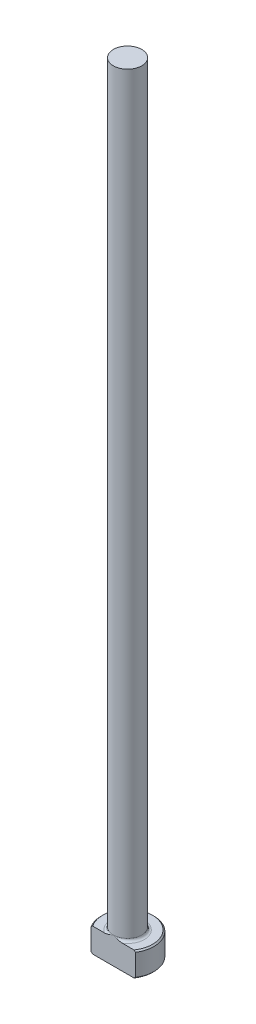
ISO-10303-21;
HEADER;
FILE_DESCRIPTION(('STEP AP214'),'2;1');
FILE_NAME('part.step','',(''),(''),'','','');
FILE_SCHEMA(('AUTOMOTIVE_DESIGN { 1 0 10303 214 1 1 1 1 }'));
ENDSEC;
DATA;
#1=APPLICATION_CONTEXT('core data for automotive mechanical design processes');
#2=APPLICATION_PROTOCOL_DEFINITION('international standard','automotive_design',2000,#1);
#3=PRODUCT_CONTEXT('',#1,'mechanical');
#4=PRODUCT('Part','Part','',(#3));
#5=PRODUCT_RELATED_PRODUCT_CATEGORY('part','',(#4));
#6=PRODUCT_DEFINITION_FORMATION('','',#4);
#7=PRODUCT_DEFINITION_CONTEXT('part definition',#1,'design');
#8=PRODUCT_DEFINITION('design','',#6,#7);
#9=PRODUCT_DEFINITION_SHAPE('','',#8);
#10=(LENGTH_UNIT() NAMED_UNIT(*) SI_UNIT(.MILLI.,.METRE.));
#11=(NAMED_UNIT(*) PLANE_ANGLE_UNIT() SI_UNIT($,.RADIAN.));
#12=(NAMED_UNIT(*) SI_UNIT($,.STERADIAN.) SOLID_ANGLE_UNIT());
#13=UNCERTAINTY_MEASURE_WITH_UNIT(LENGTH_MEASURE(1.E-05),#10,'distance_accuracy_value','');
#14=(GEOMETRIC_REPRESENTATION_CONTEXT(3) GLOBAL_UNCERTAINTY_ASSIGNED_CONTEXT((#13)) GLOBAL_UNIT_ASSIGNED_CONTEXT((#10,
#11,#12)) REPRESENTATION_CONTEXT('',''));
#15=CARTESIAN_POINT('',(0.,0.,0.));
#16=DIRECTION('',(0.,0.,1.));
#17=DIRECTION('',(1.,0.,0.));
#18=AXIS2_PLACEMENT_3D('',#15,#16,#17);
#19=CARTESIAN_POINT('',(0.,0.,0.));
#20=DIRECTION('',(0.,-1.,0.));
#21=DIRECTION('',(0.,0.,-1.));
#22=AXIS2_PLACEMENT_3D('',#19,#20,#21);
#23=PLANE('',#22);
#24=DIRECTION('',(1.,0.,0.));
#25=VECTOR('',#24,1.);
#26=CARTESIAN_POINT('',(-4.34418550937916,0.,2.77748999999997));
#27=LINE('',#26,#25);
#28=CARTESIAN_POINT('',(-4.03944478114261,0.,2.77748999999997));
#29=VERTEX_POINT('',#28);
#30=CARTESIAN_POINT('',(4.03944478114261,0.,2.77748999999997));
#31=VERTEX_POINT('',#30);
#32=EDGE_CURVE('E92',#29,#31,#27,.T.);
#33=ORIENTED_EDGE('',*,*,#32,.F.);
#34=CARTESIAN_POINT('',(0.,0.,0.));
#35=DIRECTION('',(0.,-1.,0.));
#36=DIRECTION('',(0.,0.,-1.));
#37=AXIS2_PLACEMENT_3D('',#34,#35,#36);
#38=CIRCLE('',#37,4.90220000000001);
#39=EDGE_CURVE('E105',#29,#31,#38,.T.);
#40=ORIENTED_EDGE('',*,*,#39,.T.);
#41=EDGE_LOOP('',(#33,#40));
#42=FACE_BOUND('',#41,.T.);
#43=ADVANCED_FACE('F37',(#42),#23,.T.);
#44=CARTESIAN_POINT('',(0.,259.958771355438,0.));
#45=DIRECTION('',(0.,1.,0.));
#46=DIRECTION('',(0.,0.,1.));
#47=AXIS2_PLACEMENT_3D('',#44,#45,#46);
#48=CYLINDRICAL_SURFACE('',#47,5.15619999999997);
#49=DIRECTION('',(0.,-1.,0.));
#50=VECTOR('',#49,1.);
#51=CARTESIAN_POINT('',(-4.34418550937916,152.4,2.77748999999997));
#52=LINE('',#51,#50);
#53=CARTESIAN_POINT('',(-4.34418550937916,4.49580000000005,2.77748999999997));
#54=VERTEX_POINT('',#53);
#55=CARTESIAN_POINT('',(-4.34418550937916,0.253999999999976,2.77748999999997));
#56=VERTEX_POINT('',#55);
#57=EDGE_CURVE('E95',#54,#56,#52,.T.);
#58=ORIENTED_EDGE('',*,*,#57,.F.);
#59=CARTESIAN_POINT('',(0.,4.49580000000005,0.));
#60=DIRECTION('',(0.,1.,0.));
#61=DIRECTION('',(0.,0.,1.));
#62=AXIS2_PLACEMENT_3D('',#59,#60,#61);
#63=CIRCLE('',#62,5.15619999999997);
#64=CARTESIAN_POINT('',(4.34418550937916,4.49580000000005,2.77748999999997));
#65=VERTEX_POINT('',#64);
#66=EDGE_CURVE('E109',#54,#65,#63,.F.);
#67=ORIENTED_EDGE('',*,*,#66,.T.);
#68=DIRECTION('',(0.,-1.,0.));
#69=VECTOR('',#68,1.);
#70=CARTESIAN_POINT('',(4.34418550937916,152.4,2.77748999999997));
#71=LINE('',#70,#69);
#72=CARTESIAN_POINT('',(4.34418550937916,0.253999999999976,2.77748999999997));
#73=VERTEX_POINT('',#72);
#74=EDGE_CURVE('E187',#65,#73,#71,.T.);
#75=ORIENTED_EDGE('',*,*,#74,.T.);
#76=CARTESIAN_POINT('',(0.,0.253999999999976,0.));
#77=DIRECTION('',(0.,-1.,0.));
#78=DIRECTION('',(0.,0.,-1.));
#79=AXIS2_PLACEMENT_3D('',#76,#77,#78);
#80=CIRCLE('',#79,5.15619999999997);
#81=EDGE_CURVE('E115',#73,#56,#80,.F.);
#82=ORIENTED_EDGE('',*,*,#81,.T.);
#83=EDGE_LOOP('',(#58,#67,#75,#82));
#84=FACE_BOUND('',#83,.T.);
#85=ADVANCED_FACE('F160',(#84),#48,.T.);
#86=CARTESIAN_POINT('',(-5.15619999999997,4.7498,0.));
#87=DIRECTION('',(0.,1.,0.));
#88=DIRECTION('',(0.,0.,1.));
#89=AXIS2_PLACEMENT_3D('',#86,#87,#88);
#90=PLANE('',#89);
#91=DIRECTION('',(-1.,0.,0.));
#92=VECTOR('',#91,1.);
#93=CARTESIAN_POINT('',(-5.15619999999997,4.7498,2.77748999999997));
#94=LINE('',#93,#92);
#95=CARTESIAN_POINT('',(4.03944478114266,4.7498,2.77748999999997));
#96=VERTEX_POINT('',#95);
#97=CARTESIAN_POINT('',(1.75499112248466,4.7498,2.77748999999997));
#98=VERTEX_POINT('',#97);
#99=EDGE_CURVE('E58',#96,#98,#94,.T.);
#100=ORIENTED_EDGE('',*,*,#99,.F.);
#101=CARTESIAN_POINT('',(0.,4.7498,0.));
#102=DIRECTION('',(0.,1.,0.));
#103=DIRECTION('',(0.,0.,1.));
#104=AXIS2_PLACEMENT_3D('',#101,#102,#103);
#105=CIRCLE('',#104,4.90220000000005);
#106=CARTESIAN_POINT('',(-4.03944478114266,4.7498,2.77748999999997));
#107=VERTEX_POINT('',#106);
#108=EDGE_CURVE('E182',#96,#107,#105,.T.);
#109=ORIENTED_EDGE('',*,*,#108,.T.);
#110=CARTESIAN_POINT('',(-1.75499112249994,4.74979999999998,2.77748999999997));
#111=VERTEX_POINT('',#110);
#112=EDGE_CURVE('E140',#111,#107,#94,.T.);
#113=ORIENTED_EDGE('',*,*,#112,.F.);
#114=CARTESIAN_POINT('',(0.,4.7498,0.));
#115=DIRECTION('',(0.,1.,0.));
#116=DIRECTION('',(0.,0.,1.));
#117=AXIS2_PLACEMENT_3D('',#114,#115,#116);
#118=CIRCLE('',#117,3.28548999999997);
#119=EDGE_CURVE('E112',#111,#98,#118,.F.);
#120=ORIENTED_EDGE('',*,*,#119,.T.);
#121=EDGE_LOOP('',(#100,#109,#113,#120));
#122=FACE_BOUND('',#121,.T.);
#123=ADVANCED_FACE('F164',(#122),#90,.T.);
#124=CARTESIAN_POINT('',(0.,259.958771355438,0.));
#125=DIRECTION('',(0.,1.,0.));
#126=DIRECTION('',(0.,0.,1.));
#127=AXIS2_PLACEMENT_3D('',#124,#125,#126);
#128=CYLINDRICAL_SURFACE('',#127,2.77748999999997);
#129=CARTESIAN_POINT('',(0.,5.25779999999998,0.));
#130=DIRECTION('',(0.,1.,0.));
#131=DIRECTION('',(0.,0.,1.));
#132=AXIS2_PLACEMENT_3D('',#129,#130,#131);
#133=CIRCLE('',#132,2.77748999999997);
#134=CARTESIAN_POINT('',(0.,5.25779999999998,2.77748999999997));
#135=VERTEX_POINT('',#134);
#136=EDGE_CURVE('E108',#135,#135,#133,.T.);
#137=ORIENTED_EDGE('',*,*,#136,.T.);
#138=EDGE_LOOP('',(#137));
#139=FACE_BOUND('',#138,.T.);
#140=CARTESIAN_POINT('',(0.,152.4,0.));
#141=DIRECTION('',(0.,1.,0.));
#142=DIRECTION('',(0.,0.,1.));
#143=AXIS2_PLACEMENT_3D('',#140,#141,#142);
#144=CIRCLE('',#143,2.77748999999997);
#145=CARTESIAN_POINT('',(0.,152.4,2.77748999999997));
#146=VERTEX_POINT('',#145);
#147=EDGE_CURVE('E100',#146,#146,#144,.T.);
#148=ORIENTED_EDGE('',*,*,#147,.F.);
#149=EDGE_LOOP('',(#148));
#150=FACE_BOUND('',#149,.T.);
#151=ADVANCED_FACE('F169',(#139,#150),#128,.T.);
#152=CARTESIAN_POINT('',(-2.77748999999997,152.4,0.));
#153=DIRECTION('',(0.,1.,0.));
#154=DIRECTION('',(0.,0.,1.));
#155=AXIS2_PLACEMENT_3D('',#152,#153,#154);
#156=PLANE('',#155);
#157=ORIENTED_EDGE('',*,*,#147,.T.);
#158=EDGE_LOOP('',(#157));
#159=FACE_BOUND('',#158,.T.);
#160=ADVANCED_FACE('F127',(#159),#156,.T.);
#161=CARTESIAN_POINT('',(0.,4.74980000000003,0.));
#162=DIRECTION('',(0.,-1.,0.));
#163=DIRECTION('',(0.,0.,-1.));
#164=AXIS2_PLACEMENT_3D('',#161,#162,#163);
#165=CONICAL_SURFACE('',#164,4.90220000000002,0.785398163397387);
#166=CARTESIAN_POINT('',(4.34488550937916,4.49521022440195,2.77748999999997));
#167=CARTESIAN_POINT('',(4.20993690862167,4.60885588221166,2.77748999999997));
#168=CARTESIAN_POINT('',(4.07427343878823,4.72167469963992,2.77748999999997));
#169=CARTESIAN_POINT('',(3.80095692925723,4.94505099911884,2.77748999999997));
#170=CARTESIAN_POINT('',(3.66330268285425,5.0556070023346,2.77748999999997));
#171=CARTESIAN_POINT('',(3.38009900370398,5.27803624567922,2.77748999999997));
#172=CARTESIAN_POINT('',(3.23445316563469,5.38978734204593,2.77748999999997));
#173=CARTESIAN_POINT('',(2.93986117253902,5.60879512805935,2.77748999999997));
#174=CARTESIAN_POINT('',(2.79091596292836,5.71605308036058,2.77748999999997));
#175=CARTESIAN_POINT('',(2.48820661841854,5.92459661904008,2.77748999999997));
#176=CARTESIAN_POINT('',(2.33442927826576,6.02586317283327,2.77748999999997));
#177=CARTESIAN_POINT('',(2.02092534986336,6.21931846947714,2.77748999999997));
#178=CARTESIAN_POINT('',(1.86119293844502,6.31149798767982,2.77748999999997));
#179=CARTESIAN_POINT('',(1.61743593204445,6.4386068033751,2.77748999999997));
#180=CARTESIAN_POINT('',(1.53618520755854,6.47882584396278,2.77748999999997));
#181=CARTESIAN_POINT('',(1.37175662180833,6.55509214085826,2.77748999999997));
#182=CARTESIAN_POINT('',(1.28857851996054,6.59113887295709,2.77748999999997));
#183=CARTESIAN_POINT('',(1.0362891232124,6.69148417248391,2.77748999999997));
#184=CARTESIAN_POINT('',(0.863938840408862,6.74825197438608,2.77748999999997));
#185=CARTESIAN_POINT('',(0.599330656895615,6.81189394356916,2.77748999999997));
#186=CARTESIAN_POINT('',(0.509632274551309,6.82955765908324,2.77748999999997));
#187=CARTESIAN_POINT('',(0.328961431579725,6.85652082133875,2.77748999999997));
#188=CARTESIAN_POINT('',(0.237989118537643,6.86582122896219,2.77748999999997));
#189=CARTESIAN_POINT('',(0.0557770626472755,6.87543652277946,2.77748999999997));
#190=CARTESIAN_POINT('',(-0.0354615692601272,6.87577221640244,2.77748999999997));
#191=CARTESIAN_POINT('',(-0.217532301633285,6.86748964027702,2.77748999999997));
#192=CARTESIAN_POINT('',(-0.30836436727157,6.85887061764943,2.77748999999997));
#193=CARTESIAN_POINT('',(-0.487727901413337,6.83339482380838,2.77748999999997));
#194=CARTESIAN_POINT('',(-0.576273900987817,6.81663841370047,2.77748999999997));
#195=CARTESIAN_POINT('',(-0.751660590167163,6.77586328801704,2.77748999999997));
#196=CARTESIAN_POINT('',(-0.838501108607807,6.75184384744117,2.77748999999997));
#197=CARTESIAN_POINT('',(-1.01126966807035,6.69729035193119,2.77748999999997));
#198=CARTESIAN_POINT('',(-1.09717311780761,6.66667935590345,2.77748999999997));
#199=CARTESIAN_POINT('',(-1.26688365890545,6.60022140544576,2.77748999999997));
#200=CARTESIAN_POINT('',(-1.35069119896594,6.56437558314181,2.77748999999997));
#201=CARTESIAN_POINT('',(-1.57329136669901,6.46229361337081,2.77748999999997));
#202=CARTESIAN_POINT('',(-1.71026804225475,6.3921087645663,2.77748999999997));
#203=CARTESIAN_POINT('',(-1.9795048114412,6.24314123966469,2.77748999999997));
#204=CARTESIAN_POINT('',(-2.11176089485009,6.16435147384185,2.77748999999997));
#205=CARTESIAN_POINT('',(-2.37294305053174,6.0002947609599,2.77748999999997));
#206=CARTESIAN_POINT('',(-2.50185266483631,5.91500181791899,2.77748999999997));
#207=CARTESIAN_POINT('',(-2.75650815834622,5.73993540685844,2.77748999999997));
#208=CARTESIAN_POINT('',(-2.88225502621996,5.65016336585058,2.77748999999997));
#209=CARTESIAN_POINT('',(-3.12213616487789,5.47395421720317,2.77748999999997));
#210=CARTESIAN_POINT('',(-3.23644602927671,5.38775497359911,2.77748999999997));
#211=CARTESIAN_POINT('',(-3.46333532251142,5.21309197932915,2.77748999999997));
#212=CARTESIAN_POINT('',(-3.57591458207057,5.12462800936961,2.77748999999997));
#213=CARTESIAN_POINT('',(-3.798558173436,4.94678562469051,2.77748999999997));
#214=CARTESIAN_POINT('',(-3.90863631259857,4.8574244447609,2.77748999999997));
#215=CARTESIAN_POINT('',(-4.12759528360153,4.67729610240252,2.77748999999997));
#216=CARTESIAN_POINT('',(-4.23647638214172,4.58652926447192,2.77748999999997));
#217=CARTESIAN_POINT('',(-4.34488550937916,4.49521022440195,2.77748999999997));
#218=B_SPLINE_CURVE_WITH_KNOTS('',3,(#166,#167,#168,#169,#170,#171,#172,#173,#174,#175,#176,
#177,#178,#179,#180,#181,#182,#183,#184,#185,#186,#187,#188,#189,#190,#191,#192,#193,#194,#195,
#196,#197,#198,#199,#200,#201,#202,#203,#204,#205,#206,#207,#208,#209,#210,#211,#212,#213,#214,
#215,#216,#217),.UNSPECIFIED.,.F.,.F.,(4,2,2,2,2,2,2,2,2,2,2,2,2,2,2,2,2,2,2,2,2,2,2,2,2,4),(0.,
0.52929870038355,1.05893293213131,1.6096072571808,2.1601257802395,2.71230834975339,
3.26504581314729,3.53691442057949,3.80881714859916,4.35097628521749,4.6249157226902,
4.89882368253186,5.17209583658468,5.44539096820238,5.71539791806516,5.98543182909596,
6.25880745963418,6.5321240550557,6.9933732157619,7.45500531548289,7.91859069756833,
8.38202931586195,8.81149885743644,9.24101014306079,9.66634846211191,10.0915900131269),.UNSPECIFIED.);
#219=EDGE_CURVE('E63',#65,#96,#218,.T.);
#220=ORIENTED_EDGE('',*,*,#219,.F.);
#221=ORIENTED_EDGE('',*,*,#66,.F.);
#222=EDGE_CURVE('E133',#107,#54,#218,.T.);
#223=ORIENTED_EDGE('',*,*,#222,.F.);
#224=ORIENTED_EDGE('',*,*,#108,.F.);
#225=EDGE_LOOP('',(#220,#221,#223,#224));
#226=FACE_BOUND('',#225,.T.);
#227=ADVANCED_FACE('F147',(#226),#165,.T.);
#228=CARTESIAN_POINT('',(0.,0.253999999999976,0.));
#229=DIRECTION('',(0.,1.,0.));
#230=DIRECTION('',(0.,0.,1.));
#231=AXIS2_PLACEMENT_3D('',#228,#229,#230);
#232=CONICAL_SURFACE('',#231,5.15619999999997,0.785398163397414);
#233=CARTESIAN_POINT('',(-4.34488550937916,0.254589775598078,2.77748999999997));
#234=CARTESIAN_POINT('',(-4.20993690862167,0.140944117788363,2.77748999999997));
#235=CARTESIAN_POINT('',(-4.07427343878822,0.0281253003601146,2.77748999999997));
#236=CARTESIAN_POINT('',(-3.8009569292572,-0.195250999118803,2.77748999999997));
#237=CARTESIAN_POINT('',(-3.66330268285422,-0.305807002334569,2.77748999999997));
#238=CARTESIAN_POINT('',(-3.38009900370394,-0.528236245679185,2.77748999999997));
#239=CARTESIAN_POINT('',(-3.23445316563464,-0.639987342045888,2.77748999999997));
#240=CARTESIAN_POINT('',(-2.93986117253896,-0.858995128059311,2.77748999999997));
#241=CARTESIAN_POINT('',(-2.79091596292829,-0.966253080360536,2.77748999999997));
#242=CARTESIAN_POINT('',(-2.48820661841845,-1.17479661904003,2.77748999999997));
#243=CARTESIAN_POINT('',(-2.33442927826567,-1.27606317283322,2.77748999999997));
#244=CARTESIAN_POINT('',(-2.02092534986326,-1.46951846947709,2.77748999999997));
#245=CARTESIAN_POINT('',(-1.8611929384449,-1.56169798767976,2.77748999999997));
#246=CARTESIAN_POINT('',(-1.61743593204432,-1.68880680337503,2.77748999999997));
#247=CARTESIAN_POINT('',(-1.5361852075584,-1.72902584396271,2.77748999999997));
#248=CARTESIAN_POINT('',(-1.37175662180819,-1.80529214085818,2.77748999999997));
#249=CARTESIAN_POINT('',(-1.2885785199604,-1.84133887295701,2.77748999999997));
#250=CARTESIAN_POINT('',(-1.03628912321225,-1.94168417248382,2.77748999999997));
#251=CARTESIAN_POINT('',(-0.8639388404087,-1.99845197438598,2.77748999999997));
#252=CARTESIAN_POINT('',(-0.59933065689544,-2.06209394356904,2.77748999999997));
#253=CARTESIAN_POINT('',(-0.509632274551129,-2.07975765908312,2.77748999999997));
#254=CARTESIAN_POINT('',(-0.328961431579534,-2.10672082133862,2.77748999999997));
#255=CARTESIAN_POINT('',(-0.237989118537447,-2.11602122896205,2.77748999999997));
#256=CARTESIAN_POINT('',(-0.0557770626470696,-2.12563652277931,2.77748999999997));
#257=CARTESIAN_POINT('',(0.0354615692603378,-2.12597221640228,2.77748999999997));
#258=CARTESIAN_POINT('',(0.217532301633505,-2.11768964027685,2.77748999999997));
#259=CARTESIAN_POINT('',(0.308364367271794,-2.10907061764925,2.77748999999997));
#260=CARTESIAN_POINT('',(0.487727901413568,-2.08359482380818,2.77748999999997));
#261=CARTESIAN_POINT('',(0.57627390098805,-2.06683841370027,2.77748999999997));
#262=CARTESIAN_POINT('',(0.751660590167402,-2.02606328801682,2.77748999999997));
#263=CARTESIAN_POINT('',(0.838501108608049,-2.00204384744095,2.77748999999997));
#264=CARTESIAN_POINT('',(1.0112696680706,-1.94749035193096,2.77748999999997));
#265=CARTESIAN_POINT('',(1.09717311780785,-1.91687935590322,2.77748999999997));
#266=CARTESIAN_POINT('',(1.2668836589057,-1.85042140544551,2.77748999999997));
#267=CARTESIAN_POINT('',(1.35069119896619,-1.81457558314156,2.77748999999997));
#268=CARTESIAN_POINT('',(1.57329136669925,-1.71249361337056,2.77748999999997));
#269=CARTESIAN_POINT('',(1.71026804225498,-1.64230876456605,2.77748999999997));
#270=CARTESIAN_POINT('',(1.97950481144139,-1.49334123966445,2.77748999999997));
#271=CARTESIAN_POINT('',(2.11176089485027,-1.41455147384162,2.77748999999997));
#272=CARTESIAN_POINT('',(2.37294305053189,-1.25049476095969,2.77748999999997));
#273=CARTESIAN_POINT('',(2.50185266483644,-1.1652018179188,2.77748999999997));
#274=CARTESIAN_POINT('',(2.75650815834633,-0.99013540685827,2.77748999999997));
#275=CARTESIAN_POINT('',(2.88225502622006,-0.900363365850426,2.77748999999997));
#276=CARTESIAN_POINT('',(3.12213616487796,-0.724154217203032,2.77748999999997));
#277=CARTESIAN_POINT('',(3.23644602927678,-0.637954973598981,2.77748999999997));
#278=CARTESIAN_POINT('',(3.46333532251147,-0.463291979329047,2.77748999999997));
#279=CARTESIAN_POINT('',(3.57591458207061,-0.374828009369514,2.77748999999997));
#280=CARTESIAN_POINT('',(3.79855817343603,-0.196985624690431,2.77748999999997));
#281=CARTESIAN_POINT('',(3.90863631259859,-0.107624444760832,2.77748999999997));
#282=CARTESIAN_POINT('',(4.12759528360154,0.0725038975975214,2.77748999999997));
#283=CARTESIAN_POINT('',(4.23647638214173,0.16327073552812,2.77748999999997));
#284=CARTESIAN_POINT('',(4.34488550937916,0.254589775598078,2.77748999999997));
#285=B_SPLINE_CURVE_WITH_KNOTS('',3,(#233,#234,#235,#236,#237,#238,#239,#240,#241,#242,#243,
#244,#245,#246,#247,#248,#249,#250,#251,#252,#253,#254,#255,#256,#257,#258,#259,#260,#261,#262,
#263,#264,#265,#266,#267,#268,#269,#270,#271,#272,#273,#274,#275,#276,#277,#278,#279,#280,#281,
#282,#283,#284),.UNSPECIFIED.,.F.,.F.,(4,2,2,2,2,2,2,2,2,2,2,2,2,2,2,2,2,2,2,2,2,2,2,2,2,4),(0.,
0.52929870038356,1.05893293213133,1.60960725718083,2.16012578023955,2.71230834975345,
3.26504581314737,3.53691442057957,3.80881714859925,4.3509762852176,4.62491572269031,
4.898823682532,5.17209583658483,5.44539096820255,5.71539791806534,5.98543182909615,
6.25880745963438,6.53212405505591,6.99337321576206,7.455005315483,7.91859069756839,
8.38202931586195,8.81149885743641,9.24101014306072,9.66634846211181,10.0915900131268),.UNSPECIFIED.);
#286=EDGE_CURVE('E89',#56,#29,#285,.T.);
#287=ORIENTED_EDGE('',*,*,#286,.F.);
#288=ORIENTED_EDGE('',*,*,#81,.F.);
#289=EDGE_CURVE('E101',#31,#73,#285,.T.);
#290=ORIENTED_EDGE('',*,*,#289,.F.);
#291=ORIENTED_EDGE('',*,*,#39,.F.);
#292=EDGE_LOOP('',(#287,#288,#290,#291));
#293=FACE_BOUND('',#292,.T.);
#294=ADVANCED_FACE('F107',(#293),#232,.T.);
#295=CARTESIAN_POINT('',(0.,5.25779999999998,0.));
#296=DIRECTION('',(0.,1.,0.));
#297=DIRECTION('',(0.,0.,1.));
#298=AXIS2_PLACEMENT_3D('',#295,#296,#297);
#299=TOROIDAL_SURFACE('',#298,3.28548999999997,0.508);
#300=ORIENTED_EDGE('',*,*,#119,.F.);
#301=CARTESIAN_POINT('',(0.,5.25779999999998,2.77748999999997));
#302=CARTESIAN_POINT('',(3.63480565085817E-11,5.25780081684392,2.77748999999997));
#303=CARTESIAN_POINT('',(-1.58527088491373E-07,5.25780163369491,2.77748999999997));
#304=CARTESIAN_POINT('',(-6.68759388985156E-07,5.25780321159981,2.77748999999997));
#305=CARTESIAN_POINT('',(-1.02470275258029E-06,5.25780397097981,2.77748999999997));
#306=CARTESIAN_POINT('',(-1.88230728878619E-06,5.25780548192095,2.77748999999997));
#307=CARTESIAN_POINT('',(-2.39329363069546E-06,5.25780622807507,2.77748999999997));
#308=CARTESIAN_POINT('',(-3.50054720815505E-06,5.25780764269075,2.77748999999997));
#309=CARTESIAN_POINT('',(-4.09620350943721E-06,5.25780831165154,2.77748999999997));
#310=CARTESIAN_POINT('',(-6.21505861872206E-06,5.25781052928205,2.77748999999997));
#311=CARTESIAN_POINT('',(-7.84997964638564E-06,5.25781197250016,2.77748999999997));
#312=CARTESIAN_POINT('',(-1.12461435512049E-05,5.25781456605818,2.77748999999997));
#313=CARTESIAN_POINT('',(-1.30017650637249E-05,5.25781572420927,2.77748999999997));
#314=CARTESIAN_POINT('',(-1.97830813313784E-05,5.25782001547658,2.77748999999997));
#315=CARTESIAN_POINT('',(-2.49606936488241E-05,5.25782291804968,2.77748999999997));
#316=CARTESIAN_POINT('',(-3.52264964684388E-05,5.25782772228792,2.77748999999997));
#317=CARTESIAN_POINT('',(-4.02861099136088E-05,5.25782968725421,2.77748999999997));
#318=CARTESIAN_POINT('',(-6.16428547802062E-05,5.2578379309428,2.77748999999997));
#319=CARTESIAN_POINT('',(-7.79686338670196E-05,5.25784410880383,2.77748999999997));
#320=CARTESIAN_POINT('',(-0.000108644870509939,5.25785412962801,2.77748999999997));
#321=CARTESIAN_POINT('',(-0.00012292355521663,5.2578581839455,2.77748999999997));
#322=CARTESIAN_POINT('',(-0.000225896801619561,5.25789001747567,2.77748999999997));
#323=CARTESIAN_POINT('',(-0.000310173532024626,5.25793021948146,2.77748999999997));
#324=CARTESIAN_POINT('',(-0.00063679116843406,5.25808026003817,2.77748999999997));
#325=CARTESIAN_POINT('',(-0.000882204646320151,5.25818086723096,2.77748999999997));
#326=CARTESIAN_POINT('',(-0.0018311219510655,5.25857573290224,2.77748999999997));
#327=CARTESIAN_POINT('',(-0.00253146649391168,5.25887966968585,2.77748999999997));
#328=CARTESIAN_POINT('',(-0.00538269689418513,5.26011107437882,2.77748999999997));
#329=CARTESIAN_POINT('',(-0.00753706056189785,5.26102768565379,2.77748999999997));
#330=CARTESIAN_POINT('',(-0.0523267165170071,5.28009176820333,2.77748999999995));
#331=CARTESIAN_POINT('',(-0.0949226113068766,5.29836433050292,2.77748999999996));
#332=CARTESIAN_POINT('',(-0.178660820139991,5.33400805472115,2.77748999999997));
#333=CARTESIAN_POINT('',(-0.219799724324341,5.35138784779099,2.77748999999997));
#334=CARTESIAN_POINT('',(-0.306925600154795,5.38783884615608,2.77748999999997));
#335=CARTESIAN_POINT('',(-0.352927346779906,5.40687537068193,2.77748999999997));
#336=CARTESIAN_POINT('',(-0.445632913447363,5.44454742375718,2.77748999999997));
#337=CARTESIAN_POINT('',(-0.492339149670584,5.46317702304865,2.77748999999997));
#338=CARTESIAN_POINT('',(-0.574123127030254,5.49497229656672,2.77748999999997));
#339=CARTESIAN_POINT('',(-0.60912979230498,5.50832012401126,2.77748999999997));
#340=CARTESIAN_POINT('',(-0.679265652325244,5.53442851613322,2.77748999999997));
#341=CARTESIAN_POINT('',(-0.714394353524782,5.54719040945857,2.77748999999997));
#342=CARTESIAN_POINT('',(-0.818611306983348,5.58395598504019,2.77748999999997));
#343=CARTESIAN_POINT('',(-0.888033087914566,5.60703279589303,2.77748999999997));
#344=CARTESIAN_POINT('',(-1.01885178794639,5.64701930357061,2.77748999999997));
#345=CARTESIAN_POINT('',(-1.0801217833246,5.66434067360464,2.77748999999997));
#346=CARTESIAN_POINT('',(-1.20389830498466,5.69582437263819,2.77748999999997));
#347=CARTESIAN_POINT('',(-1.26641022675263,5.70996583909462,2.77748999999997));
#348=CARTESIAN_POINT('',(-1.39563114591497,5.73475443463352,2.77748999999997));
#349=CARTESIAN_POINT('',(-1.46238514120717,5.74517289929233,2.77748999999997));
#350=CARTESIAN_POINT('',(-1.5964208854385,5.76016238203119,2.77748999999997));
#351=CARTESIAN_POINT('',(-1.6637008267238,5.76474842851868,2.77748999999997));
#352=CARTESIAN_POINT('',(-1.78334896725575,5.76633336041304,2.77748999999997));
#353=CARTESIAN_POINT('',(-1.83569286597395,5.76479753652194,2.77748999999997));
#354=CARTESIAN_POINT('',(-1.93953534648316,5.75634035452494,2.77748999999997));
#355=CARTESIAN_POINT('',(-1.99103732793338,5.74946529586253,2.77748999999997));
#356=CARTESIAN_POINT('',(-2.09352832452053,5.72907082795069,2.77748999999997));
#357=CARTESIAN_POINT('',(-2.14449935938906,5.71545744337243,2.77748999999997));
#358=CARTESIAN_POINT('',(-2.2436267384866,5.67996337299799,2.77748999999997));
#359=CARTESIAN_POINT('',(-2.29178599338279,5.65809141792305,2.77748999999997));
#360=CARTESIAN_POINT('',(-2.36178980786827,5.61652411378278,2.77748999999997));
#361=CARTESIAN_POINT('',(-2.38569818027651,5.60030457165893,2.77748999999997));
#362=CARTESIAN_POINT('',(-2.4309629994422,5.56461281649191,2.77748999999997));
#363=CARTESIAN_POINT('',(-2.45232270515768,5.54514483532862,2.77748999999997));
#364=CARTESIAN_POINT('',(-2.48830742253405,5.50626208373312,2.77748999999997));
#365=CARTESIAN_POINT('',(-2.50346308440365,5.48734205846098,2.77748999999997));
#366=CARTESIAN_POINT('',(-2.53047517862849,5.44726495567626,2.77748999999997));
#367=CARTESIAN_POINT('',(-2.5423352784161,5.42611040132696,2.77748999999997));
#368=CARTESIAN_POINT('',(-2.56038418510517,5.3854866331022,2.77748999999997));
#369=CARTESIAN_POINT('',(-2.56717564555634,5.36628626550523,2.77748999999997));
#370=CARTESIAN_POINT('',(-2.57744003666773,5.32701469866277,2.77748999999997));
#371=CARTESIAN_POINT('',(-2.58091477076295,5.30694397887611,2.77748999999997));
#372=CARTESIAN_POINT('',(-2.58430568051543,5.26645045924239,2.77748999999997));
#373=CARTESIAN_POINT('',(-2.584213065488,5.24602691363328,2.77748999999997));
#374=CARTESIAN_POINT('',(-2.5804545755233,5.20551288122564,2.77748999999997));
#375=CARTESIAN_POINT('',(-2.57678819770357,5.18542244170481,2.77748999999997));
#376=CARTESIAN_POINT('',(-2.56632842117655,5.14683425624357,2.77748999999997));
#377=CARTESIAN_POINT('',(-2.55964787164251,5.1283054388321,2.77748999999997));
#378=CARTESIAN_POINT('',(-2.54358717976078,5.09246829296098,2.77748999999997));
#379=CARTESIAN_POINT('',(-2.53420613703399,5.07516037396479,2.77748999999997));
#380=CARTESIAN_POINT('',(-2.50902920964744,5.03545005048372,2.77748999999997));
#381=CARTESIAN_POINT('',(-2.49216203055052,5.01372616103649,2.77748999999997));
#382=CARTESIAN_POINT('',(-2.45513239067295,4.97328752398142,2.77748999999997));
#383=CARTESIAN_POINT('',(-2.43496232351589,4.95457992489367,2.77748999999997));
#384=CARTESIAN_POINT('',(-2.38311067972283,4.912743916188,2.77748999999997));
#385=CARTESIAN_POINT('',(-2.35019661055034,4.89114952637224,2.77748999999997));
#386=CARTESIAN_POINT('',(-2.28149859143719,4.85339659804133,2.77748999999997));
#387=CARTESIAN_POINT('',(-2.24571462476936,4.83723809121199,2.77748999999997));
#388=CARTESIAN_POINT('',(-2.15091163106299,4.80145440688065,2.77748999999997));
#389=CARTESIAN_POINT('',(-2.09057342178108,4.7853535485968,2.77748999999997));
#390=CARTESIAN_POINT('',(-1.96762393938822,4.76220444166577,2.77748999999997));
#391=CARTESIAN_POINT('',(-1.90499415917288,4.75526622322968,2.77748999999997));
#392=CARTESIAN_POINT('',(-1.78440975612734,4.74902507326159,2.77748999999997));
#393=CARTESIAN_POINT('',(-1.72647978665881,4.74915837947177,2.77748999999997));
#394=CARTESIAN_POINT('',(-1.61075698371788,4.75449180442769,2.77748999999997));
#395=CARTESIAN_POINT('',(-1.55296472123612,4.75970292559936,2.77748999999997));
#396=CARTESIAN_POINT('',(-1.4405603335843,4.77392629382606,2.77748999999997));
#397=CARTESIAN_POINT('',(-1.38592386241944,4.78275336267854,2.77748999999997));
#398=CARTESIAN_POINT('',(-1.27754428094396,4.8034547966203,2.77748999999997));
#399=CARTESIAN_POINT('',(-1.22379796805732,4.81531273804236,2.77748999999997));
#400=CARTESIAN_POINT('',(-1.08372355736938,4.84970148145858,2.77748999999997));
#401=CARTESIAN_POINT('',(-0.997900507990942,4.87428584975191,2.77748999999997));
#402=CARTESIAN_POINT('',(-0.869412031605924,4.91500035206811,2.77748999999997));
#403=CARTESIAN_POINT('',(-0.826169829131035,4.92938397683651,2.77748999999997));
#404=CARTESIAN_POINT('',(-0.739936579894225,4.95921802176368,2.77748999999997));
#405=CARTESIAN_POINT('',(-0.696946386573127,4.97467092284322,2.77748999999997));
#406=CARTESIAN_POINT('',(-0.596843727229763,5.0117644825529,2.77748999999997));
#407=CARTESIAN_POINT('',(-0.539854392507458,5.03373544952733,2.77748999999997));
#408=CARTESIAN_POINT('',(-0.426869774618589,5.07852412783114,2.77748999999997));
#409=CARTESIAN_POINT('',(-0.370870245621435,5.10133121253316,2.77748999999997));
#410=CARTESIAN_POINT('',(-0.264915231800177,5.14523941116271,2.77748999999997));
#411=CARTESIAN_POINT('',(-0.214932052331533,5.16627387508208,2.77748999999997));
#412=CARTESIAN_POINT('',(-0.138912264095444,5.19849280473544,2.77748999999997));
#413=CARTESIAN_POINT('',(-0.11283552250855,5.2095855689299,2.77748999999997));
#414=CARTESIAN_POINT('',(-0.0610777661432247,5.23169621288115,2.77748999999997));
#415=CARTESIAN_POINT('',(-0.0353963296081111,5.24271296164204,2.77748999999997));
#416=CARTESIAN_POINT('',(-0.00753653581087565,5.2545726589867,2.77748999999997));
#417=CARTESIAN_POINT('',(-0.00538158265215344,5.25548941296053,2.77748999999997));
#418=CARTESIAN_POINT('',(-0.00253020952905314,5.25672086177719,2.77748999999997));
#419=CARTESIAN_POINT('',(-0.00183028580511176,5.25702462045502,2.77748999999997));
#420=CARTESIAN_POINT('',(-0.00088190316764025,5.25741926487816,2.77748999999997));
#421=CARTESIAN_POINT('',(-0.000636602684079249,5.25751982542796,2.77748999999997));
#422=CARTESIAN_POINT('',(-0.000310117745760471,5.25766980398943,2.77748999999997));
#423=CARTESIAN_POINT('',(-0.000225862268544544,5.25770999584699,2.77748999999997));
#424=CARTESIAN_POINT('',(-0.000122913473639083,5.25774182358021,2.77748999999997));
#425=CARTESIAN_POINT('',(-0.000108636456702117,5.25774587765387,2.77748999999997));
#426=CARTESIAN_POINT('',(-7.7963853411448E-05,5.25775589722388,2.77748999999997));
#427=CARTESIAN_POINT('',(-6.16399947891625E-05,5.25776207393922,2.77748999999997));
#428=CARTESIAN_POINT('',(-4.02854070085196E-05,5.25777031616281,2.77748999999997));
#429=CARTESIAN_POINT('',(-3.52260605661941E-05,5.25777228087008,2.77748999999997));
#430=CARTESIAN_POINT('',(-2.49607547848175E-05,5.25777708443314,2.77748999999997));
#431=CARTESIAN_POINT('',(-1.97833633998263E-05,5.25777998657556,2.77748999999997));
#432=CARTESIAN_POINT('',(-1.30022515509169E-05,5.25778427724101,2.77748999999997));
#433=CARTESIAN_POINT('',(-1.12466509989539E-05,5.25778543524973,2.77748999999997));
#434=CARTESIAN_POINT('',(-7.85050040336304E-06,5.25778802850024,2.77748999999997));
#435=CARTESIAN_POINT('',(-6.21557047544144E-06,5.25778947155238,2.77748999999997));
#436=CARTESIAN_POINT('',(-4.09666882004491E-06,5.25779168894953,2.77748999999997));
#437=CARTESIAN_POINT('',(-3.50099231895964E-06,5.25779235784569,2.77748999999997));
#438=CARTESIAN_POINT('',(-2.39368681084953E-06,5.25779377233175,2.77748999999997));
#439=CARTESIAN_POINT('',(-1.88266863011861E-06,5.25779451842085,2.77748999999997));
#440=CARTESIAN_POINT('',(-1.02498698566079E-06,5.25779602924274,2.77748999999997));
#441=CARTESIAN_POINT('',(-6.68999756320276E-07,5.25779678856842,2.77748999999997));
#442=CARTESIAN_POINT('',(-1.58661368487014E-07,5.25779836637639,2.77748999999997));
#443=CARTESIAN_POINT('',(-3.63467834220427E-11,5.25779918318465,2.77748999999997));
#444=CARTESIAN_POINT('',(0.,5.25779999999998,2.77748999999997));
#445=B_SPLINE_CURVE_WITH_KNOTS('',3,(#301,#302,#303,#304,#305,#306,#307,#308,#309,#310,#311,
#312,#313,#314,#315,#316,#317,#318,#319,#320,#321,#322,#323,#324,#325,#326,#327,#328,#329,#330,
#331,#332,#333,#334,#335,#336,#337,#338,#339,#340,#341,#342,#343,#344,#345,#346,#347,#348,#349,
#350,#351,#352,#353,#354,#355,#356,#357,#358,#359,#360,#361,#362,#363,#364,#365,#366,#367,#368,
#369,#370,#371,#372,#373,#374,#375,#376,#377,#378,#379,#380,#381,#382,#383,#384,#385,#386,#387,
#388,#389,#390,#391,#392,#393,#394,#395,#396,#397,#398,#399,#400,#401,#402,#403,#404,#405,#406,
#407,#408,#409,#410,#411,#412,#413,#414,#415,#416,#417,#418,#419,#420,#421,#422,#423,#424,#425,
#426,#427,#428,#429,#430,#431,#432,#433,#434,#435,#436,#437,#438,#439,#440,#441,#442,#443,#444),
.UNSPECIFIED.,.T.,.F.,(4,2,2,2,2,2,2,2,2,2,2,2,2,2,2,2,2,2,2,2,2,2,2,2,2,2,2,2,2,2,2,2,2,2,2,2,
2,2,2,2,2,2,2,2,2,2,2,2,2,2,2,2,2,2,2,2,2,2,2,2,2,2,2,2,2,2,2,2,2,2,2,4),(0.,
2.44855601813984E-06,4.9523349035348E-06,7.65489054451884E-06,1.03388521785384E-05,
1.68491009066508E-05,2.31537100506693E-05,4.09008862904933E-05,5.71674519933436E-05,
0.000109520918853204,0.000154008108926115,0.000432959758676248,0.00122961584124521,
0.00351878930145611,0.0105437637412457,0.149576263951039,0.28355792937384,0.432909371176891,
0.583757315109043,0.696148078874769,0.808269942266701,1.02766943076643,1.21861436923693,
1.41077769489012,1.61326934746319,1.81523817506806,1.97211643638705,2.12764930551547,
2.28541514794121,2.44301466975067,2.52945892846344,2.61579143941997,2.68824272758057,
2.76061306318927,2.82144775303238,2.88224934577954,2.94320077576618,3.00416078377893,
3.06300679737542,3.12187245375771,3.20392380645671,3.28616684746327,3.40360419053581,
3.52104221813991,3.7073522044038,3.89587975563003,4.0694018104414,4.24330068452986,
4.40922866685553,4.5742759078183,4.84187326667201,4.97858134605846,5.115617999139,
5.29883585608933,5.48022693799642,5.64291023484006,5.72792677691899,5.8117512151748,
5.81877801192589,5.82106581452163,5.82186210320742,5.82214098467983,5.82218546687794,
5.82223781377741,5.82225407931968,5.82227182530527,5.82227812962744,5.82228463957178,
5.82228732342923,5.82229002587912,5.82229252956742,5.82229497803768),.UNSPECIFIED.);
#446=EDGE_CURVE('E11',#111,#135,#445,.T.);
#447=ORIENTED_EDGE('',*,*,#446,.T.);
#448=ORIENTED_EDGE('',*,*,#136,.F.);
#449=CARTESIAN_POINT('',(0.,5.25779999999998,2.77748999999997));
#450=CARTESIAN_POINT('',(-3.63480395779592E-11,5.25779918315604,2.77748999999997));
#451=CARTESIAN_POINT('',(1.58527088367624E-07,5.25779836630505,2.77748999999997));
#452=CARTESIAN_POINT('',(6.68759388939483E-07,5.25779678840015,2.77748999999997));
#453=CARTESIAN_POINT('',(1.02470275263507E-06,5.25779602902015,2.77748999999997));
#454=CARTESIAN_POINT('',(1.88230728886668E-06,5.25779451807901,2.77748999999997));
#455=CARTESIAN_POINT('',(2.39329363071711E-06,5.25779377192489,2.77748999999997));
#456=CARTESIAN_POINT('',(3.50054720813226E-06,5.25779235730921,2.77748999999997));
#457=CARTESIAN_POINT('',(4.09620350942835E-06,5.25779168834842,2.77748999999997));
#458=CARTESIAN_POINT('',(6.21505861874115E-06,5.25778947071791,2.77748999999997));
#459=CARTESIAN_POINT('',(7.84997964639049E-06,5.25778802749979,2.77748999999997));
#460=CARTESIAN_POINT('',(1.12461435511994E-05,5.25778543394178,2.77748999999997));
#461=CARTESIAN_POINT('',(1.30017650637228E-05,5.25778427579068,2.77748999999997));
#462=CARTESIAN_POINT('',(1.97830813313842E-05,5.25777998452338,2.77748999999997));
#463=CARTESIAN_POINT('',(2.49606936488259E-05,5.25777708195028,2.77748999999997));
#464=CARTESIAN_POINT('',(3.52264964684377E-05,5.25777227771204,2.77748999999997));
#465=CARTESIAN_POINT('',(4.02861099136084E-05,5.25777031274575,2.77748999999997));
#466=CARTESIAN_POINT('',(6.16428547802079E-05,5.25776206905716,2.77748999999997));
#467=CARTESIAN_POINT('',(7.796863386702E-05,5.25775589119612,2.77748999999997));
#468=CARTESIAN_POINT('',(0.000108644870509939,5.25774587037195,2.77748999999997));
#469=CARTESIAN_POINT('',(0.00012292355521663,5.25774181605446,2.77748999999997));
#470=CARTESIAN_POINT('',(0.000225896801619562,5.25770998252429,2.77748999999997));
#471=CARTESIAN_POINT('',(0.000310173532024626,5.2576697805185,2.77748999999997));
#472=CARTESIAN_POINT('',(0.000636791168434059,5.25751973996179,2.77748999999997));
#473=CARTESIAN_POINT('',(0.00088220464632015,5.257419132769,2.77748999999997));
#474=CARTESIAN_POINT('',(0.0018311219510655,5.25702426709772,2.77748999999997));
#475=CARTESIAN_POINT('',(0.00253146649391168,5.25672033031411,2.77748999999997));
#476=CARTESIAN_POINT('',(0.00538269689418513,5.25548892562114,2.77748999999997));
#477=CARTESIAN_POINT('',(0.00753706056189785,5.25457231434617,2.77748999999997));
#478=CARTESIAN_POINT('',(0.0523267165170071,5.23550823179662,2.77748999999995));
#479=CARTESIAN_POINT('',(0.0949226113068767,5.21723566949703,2.77748999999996));
#480=CARTESIAN_POINT('',(0.178660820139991,5.18159194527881,2.77748999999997));
#481=CARTESIAN_POINT('',(0.219799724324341,5.16421215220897,2.77748999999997));
#482=CARTESIAN_POINT('',(0.306925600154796,5.12776115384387,2.77748999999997));
#483=CARTESIAN_POINT('',(0.352927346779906,5.10872462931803,2.77748999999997));
#484=CARTESIAN_POINT('',(0.445632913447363,5.07105257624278,2.77748999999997));
#485=CARTESIAN_POINT('',(0.492339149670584,5.05242297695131,2.77748999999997));
#486=CARTESIAN_POINT('',(0.574123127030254,5.02062770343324,2.77748999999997));
#487=CARTESIAN_POINT('',(0.60912979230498,5.0072798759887,2.77748999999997));
#488=CARTESIAN_POINT('',(0.679265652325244,4.98117148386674,2.77748999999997));
#489=CARTESIAN_POINT('',(0.714394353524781,4.96840959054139,2.77748999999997));
#490=CARTESIAN_POINT('',(0.818611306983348,4.93164401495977,2.77748999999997));
#491=CARTESIAN_POINT('',(0.888033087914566,4.90856720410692,2.77748999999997));
#492=CARTESIAN_POINT('',(1.01885178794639,4.86858069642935,2.77748999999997));
#493=CARTESIAN_POINT('',(1.0801217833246,4.85125932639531,2.77748999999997));
#494=CARTESIAN_POINT('',(1.20389830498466,4.81977562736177,2.77748999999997));
#495=CARTESIAN_POINT('',(1.26641022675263,4.80563416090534,2.77748999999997));
#496=CARTESIAN_POINT('',(1.39563114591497,4.78084556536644,2.77748999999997));
#497=CARTESIAN_POINT('',(1.46238514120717,4.77042710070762,2.77748999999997));
#498=CARTESIAN_POINT('',(1.5964208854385,4.75543761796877,2.77748999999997));
#499=CARTESIAN_POINT('',(1.6637008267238,4.75085157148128,2.77748999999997));
#500=CARTESIAN_POINT('',(1.78334896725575,4.74926663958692,2.77748999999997));
#501=CARTESIAN_POINT('',(1.83569286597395,4.75080246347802,2.77748999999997));
#502=CARTESIAN_POINT('',(1.93953534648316,4.75925964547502,2.77748999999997));
#503=CARTESIAN_POINT('',(1.99103732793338,4.76613470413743,2.77748999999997));
#504=CARTESIAN_POINT('',(2.09352832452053,4.78652917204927,2.77748999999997));
#505=CARTESIAN_POINT('',(2.14449935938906,4.80014255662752,2.77748999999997));
#506=CARTESIAN_POINT('',(2.2436267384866,4.83563662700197,2.77748999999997));
#507=CARTESIAN_POINT('',(2.29178599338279,4.85750858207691,2.77748999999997));
#508=CARTESIAN_POINT('',(2.36178980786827,4.89907588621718,2.77748999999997));
#509=CARTESIAN_POINT('',(2.38569818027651,4.91529542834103,2.77748999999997));
#510=CARTESIAN_POINT('',(2.4309629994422,4.95098718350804,2.77748999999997));
#511=CARTESIAN_POINT('',(2.45232270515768,4.97045516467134,2.77748999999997));
#512=CARTESIAN_POINT('',(2.48830742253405,5.00933791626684,2.77748999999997));
#513=CARTESIAN_POINT('',(2.50346308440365,5.02825794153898,2.77748999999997));
#514=CARTESIAN_POINT('',(2.53047517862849,5.0683350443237,2.77748999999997));
#515=CARTESIAN_POINT('',(2.5423352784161,5.089489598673,2.77748999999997));
#516=CARTESIAN_POINT('',(2.56038418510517,5.13011336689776,2.77748999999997));
#517=CARTESIAN_POINT('',(2.56717564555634,5.14931373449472,2.77748999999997));
#518=CARTESIAN_POINT('',(2.57744003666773,5.18858530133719,2.77748999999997));
#519=CARTESIAN_POINT('',(2.58091477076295,5.20865602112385,2.77748999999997));
#520=CARTESIAN_POINT('',(2.58430568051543,5.24914954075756,2.77748999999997));
#521=CARTESIAN_POINT('',(2.584213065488,5.26957308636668,2.77748999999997));
#522=CARTESIAN_POINT('',(2.5804545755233,5.31008711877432,2.77748999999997));
#523=CARTESIAN_POINT('',(2.57678819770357,5.33017755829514,2.77748999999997));
#524=CARTESIAN_POINT('',(2.56632842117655,5.36876574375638,2.77748999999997));
#525=CARTESIAN_POINT('',(2.55964787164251,5.38729456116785,2.77748999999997));
#526=CARTESIAN_POINT('',(2.54358717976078,5.42313170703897,2.77748999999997));
#527=CARTESIAN_POINT('',(2.53420613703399,5.44043962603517,2.77748999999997));
#528=CARTESIAN_POINT('',(2.50902920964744,5.48014994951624,2.77748999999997));
#529=CARTESIAN_POINT('',(2.49216203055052,5.50187383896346,2.77748999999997));
#530=CARTESIAN_POINT('',(2.45513239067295,5.54231247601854,2.77748999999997));
#531=CARTESIAN_POINT('',(2.43496232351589,5.56102007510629,2.77748999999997));
#532=CARTESIAN_POINT('',(2.38311067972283,5.60285608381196,2.77748999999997));
#533=CARTESIAN_POINT('',(2.35019661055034,5.62445047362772,2.77748999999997));
#534=CARTESIAN_POINT('',(2.28149859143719,5.66220340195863,2.77748999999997));
#535=CARTESIAN_POINT('',(2.24571462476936,5.67836190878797,2.77748999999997));
#536=CARTESIAN_POINT('',(2.15091163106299,5.71414559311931,2.77748999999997));
#537=CARTESIAN_POINT('',(2.09057342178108,5.73024645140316,2.77748999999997));
#538=CARTESIAN_POINT('',(1.96762393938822,5.75339555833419,2.77748999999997));
#539=CARTESIAN_POINT('',(1.90499415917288,5.76033377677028,2.77748999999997));
#540=CARTESIAN_POINT('',(1.78440975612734,5.76657492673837,2.77748999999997));
#541=CARTESIAN_POINT('',(1.72647978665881,5.76644162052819,2.77748999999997));
#542=CARTESIAN_POINT('',(1.61075698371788,5.76110819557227,2.77748999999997));
#543=CARTESIAN_POINT('',(1.55296472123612,5.7558970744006,2.77748999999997));
#544=CARTESIAN_POINT('',(1.4405603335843,5.7416737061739,2.77748999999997));
#545=CARTESIAN_POINT('',(1.38592386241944,5.73284663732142,2.77748999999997));
#546=CARTESIAN_POINT('',(1.27754428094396,5.71214520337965,2.77748999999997));
#547=CARTESIAN_POINT('',(1.22379796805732,5.7002872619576,2.77748999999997));
#548=CARTESIAN_POINT('',(1.08372355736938,5.66589851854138,2.77748999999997));
#549=CARTESIAN_POINT('',(0.997900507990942,5.64131415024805,2.77748999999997));
#550=CARTESIAN_POINT('',(0.869412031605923,5.60059964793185,2.77748999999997));
#551=CARTESIAN_POINT('',(0.826169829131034,5.58621602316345,2.77748999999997));
#552=CARTESIAN_POINT('',(0.739936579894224,5.55638197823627,2.77748999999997));
#553=CARTESIAN_POINT('',(0.696946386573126,5.54092907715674,2.77748999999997));
#554=CARTESIAN_POINT('',(0.596843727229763,5.50383551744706,2.77748999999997));
#555=CARTESIAN_POINT('',(0.539854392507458,5.48186455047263,2.77748999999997));
#556=CARTESIAN_POINT('',(0.426869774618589,5.43707587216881,2.77748999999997));
#557=CARTESIAN_POINT('',(0.370870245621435,5.41426878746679,2.77748999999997));
#558=CARTESIAN_POINT('',(0.264915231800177,5.37036058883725,2.77748999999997));
#559=CARTESIAN_POINT('',(0.214932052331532,5.34932612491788,2.77748999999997));
#560=CARTESIAN_POINT('',(0.138912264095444,5.31710719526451,2.77748999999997));
#561=CARTESIAN_POINT('',(0.112835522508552,5.30601443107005,2.77748999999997));
#562=CARTESIAN_POINT('',(0.0610777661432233,5.28390378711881,2.77748999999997));
#563=CARTESIAN_POINT('',(0.0353963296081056,5.27288703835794,2.77748999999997));
#564=CARTESIAN_POINT('',(0.00753653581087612,5.26102734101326,2.77748999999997));
#565=CARTESIAN_POINT('',(0.00538158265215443,5.26011058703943,2.77748999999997));
#566=CARTESIAN_POINT('',(0.00253020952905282,5.25887913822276,2.77748999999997));
#567=CARTESIAN_POINT('',(0.00183028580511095,5.25857537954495,2.77748999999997));
#568=CARTESIAN_POINT('',(0.000881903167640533,5.2581807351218,2.77748999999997));
#569=CARTESIAN_POINT('',(0.000636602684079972,5.25808017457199,2.77748999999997));
#570=CARTESIAN_POINT('',(0.000310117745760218,5.25793019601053,2.77748999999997));
#571=CARTESIAN_POINT('',(0.000225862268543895,5.25789000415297,2.77748999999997));
#572=CARTESIAN_POINT('',(0.000122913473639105,5.25785817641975,2.77748999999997));
#573=CARTESIAN_POINT('',(0.000108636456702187,5.25785412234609,2.77748999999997));
#574=CARTESIAN_POINT('',(7.79638534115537E-05,5.25784410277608,2.77748999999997));
#575=CARTESIAN_POINT('',(6.16399947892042E-05,5.25783792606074,2.77748999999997));
#576=CARTESIAN_POINT('',(4.02854070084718E-05,5.25782968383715,2.77748999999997));
#577=CARTESIAN_POINT('',(3.52260605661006E-05,5.25782771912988,2.77748999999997));
#578=CARTESIAN_POINT('',(2.49607547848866E-05,5.25782291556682,2.77748999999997));
#579=CARTESIAN_POINT('',(1.97833634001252E-05,5.2578200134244,2.77748999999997));
#580=CARTESIAN_POINT('',(1.30022515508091E-05,5.25781572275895,2.77748999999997));
#581=CARTESIAN_POINT('',(1.12466509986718E-05,5.25781456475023,2.77748999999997));
#582=CARTESIAN_POINT('',(7.85050040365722E-06,5.25781197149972,2.77748999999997));
#583=CARTESIAN_POINT('',(6.21557047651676E-06,5.25781052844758,2.77748999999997));
#584=CARTESIAN_POINT('',(4.09666881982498E-06,5.25780831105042,2.77748999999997));
#585=CARTESIAN_POINT('',(3.50099231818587E-06,5.25780764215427,2.77748999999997));
#586=CARTESIAN_POINT('',(2.39368681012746E-06,5.25780622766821,2.77748999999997));
#587=CARTESIAN_POINT('',(1.88266863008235E-06,5.25780548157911,2.77748999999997));
#588=CARTESIAN_POINT('',(1.02498698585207E-06,5.25780397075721,2.77748999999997));
#589=CARTESIAN_POINT('',(6.68999756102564E-07,5.25780321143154,2.77748999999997));
#590=CARTESIAN_POINT('',(1.58661368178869E-07,5.25780163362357,2.77748999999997));
#591=CARTESIAN_POINT('',(3.63467664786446E-11,5.25780081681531,2.77748999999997));
#592=CARTESIAN_POINT('',(0.,5.25779999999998,2.77748999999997));
#593=B_SPLINE_CURVE_WITH_KNOTS('',3,(#449,#450,#451,#452,#453,#454,#455,#456,#457,#458,#459,
#460,#461,#462,#463,#464,#465,#466,#467,#468,#469,#470,#471,#472,#473,#474,#475,#476,#477,#478,
#479,#480,#481,#482,#483,#484,#485,#486,#487,#488,#489,#490,#491,#492,#493,#494,#495,#496,#497,
#498,#499,#500,#501,#502,#503,#504,#505,#506,#507,#508,#509,#510,#511,#512,#513,#514,#515,#516,
#517,#518,#519,#520,#521,#522,#523,#524,#525,#526,#527,#528,#529,#530,#531,#532,#533,#534,#535,
#536,#537,#538,#539,#540,#541,#542,#543,#544,#545,#546,#547,#548,#549,#550,#551,#552,#553,#554,
#555,#556,#557,#558,#559,#560,#561,#562,#563,#564,#565,#566,#567,#568,#569,#570,#571,#572,#573,
#574,#575,#576,#577,#578,#579,#580,#581,#582,#583,#584,#585,#586,#587,#588,#589,#590,#591,#592),
.UNSPECIFIED.,.T.,.F.,(4,2,2,2,2,2,2,2,2,2,2,2,2,2,2,2,2,2,2,2,2,2,2,2,2,2,2,2,2,2,2,2,2,2,2,2,
2,2,2,2,2,2,2,2,2,2,2,2,2,2,2,2,2,2,2,2,2,2,2,2,2,2,2,2,2,2,2,2,2,2,2,4),(0.,
2.44855601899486E-06,4.95233490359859E-06,7.65489054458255E-06,1.0338852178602E-05,
1.68491009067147E-05,2.31537100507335E-05,4.09008862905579E-05,5.71674519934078E-05,
0.000109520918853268,0.000154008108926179,0.000432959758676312,0.00122961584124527,
0.00351878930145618,0.0105437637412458,0.149576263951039,0.28355792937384,0.432909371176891,
0.583757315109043,0.696148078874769,0.8082699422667,1.02766943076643,1.21861436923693,
1.41077769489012,1.61326934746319,1.81523817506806,1.97211643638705,2.12764930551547,
2.28541514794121,2.44301466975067,2.52945892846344,2.61579143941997,2.68824272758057,
2.76061306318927,2.82144775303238,2.88224934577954,2.94320077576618,3.00416078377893,
3.06300679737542,3.12187245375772,3.20392380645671,3.28616684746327,3.40360419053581,
3.52104221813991,3.7073522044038,3.89587975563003,4.0694018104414,4.24330068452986,
4.40922866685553,4.5742759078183,4.84187326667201,4.97858134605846,5.115617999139,
5.29883585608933,5.48022693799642,5.64291023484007,5.72792677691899,5.8117512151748,
5.81877801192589,5.82106581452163,5.82186210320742,5.82214098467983,5.82218546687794,
5.82223781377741,5.82225407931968,5.82227182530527,5.82227812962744,5.82228463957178,
5.82228732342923,5.82229002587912,5.82229252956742,5.82229497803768),.UNSPECIFIED.);
#594=EDGE_CURVE('E51',#135,#98,#593,.T.);
#595=ORIENTED_EDGE('',*,*,#594,.T.);
#596=EDGE_LOOP('',(#300,#447,#448,#595));
#597=FACE_BOUND('',#596,.T.);
#598=ADVANCED_FACE('F39',(#597),#299,.F.);
#599=CARTESIAN_POINT('',(-4.34418550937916,152.4,2.77748999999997));
#600=DIRECTION('',(0.,0.,-1.));
#601=DIRECTION('',(-1.,0.,0.));
#602=AXIS2_PLACEMENT_3D('',#599,#600,#601);
#603=PLANE('',#602);
#604=ORIENTED_EDGE('',*,*,#286,.T.);
#605=ORIENTED_EDGE('',*,*,#32,.T.);
#606=ORIENTED_EDGE('',*,*,#289,.T.);
#607=ORIENTED_EDGE('',*,*,#74,.F.);
#608=ORIENTED_EDGE('',*,*,#219,.T.);
#609=ORIENTED_EDGE('',*,*,#99,.T.);
#610=ORIENTED_EDGE('',*,*,#594,.F.);
#611=ORIENTED_EDGE('',*,*,#446,.F.);
#612=ORIENTED_EDGE('',*,*,#112,.T.);
#613=ORIENTED_EDGE('',*,*,#222,.T.);
#614=ORIENTED_EDGE('',*,*,#57,.T.);
#615=EDGE_LOOP('',(#604,#605,#606,#607,#608,#609,#610,#611,#612,#613,#614));
#616=FACE_BOUND('',#615,.T.);
#617=ADVANCED_FACE('F91',(#616),#603,.F.);
#618=CLOSED_SHELL('',(#43,#85,#123,#151,#160,#227,#294,#598,#617));
#619=MANIFOLD_SOLID_BREP('B2',#618);
#620=ADVANCED_BREP_SHAPE_REPRESENTATION('',(#18,#619),#14);
#621=SHAPE_DEFINITION_REPRESENTATION(#9,#620);
ENDSEC;
END-ISO-10303-21;
